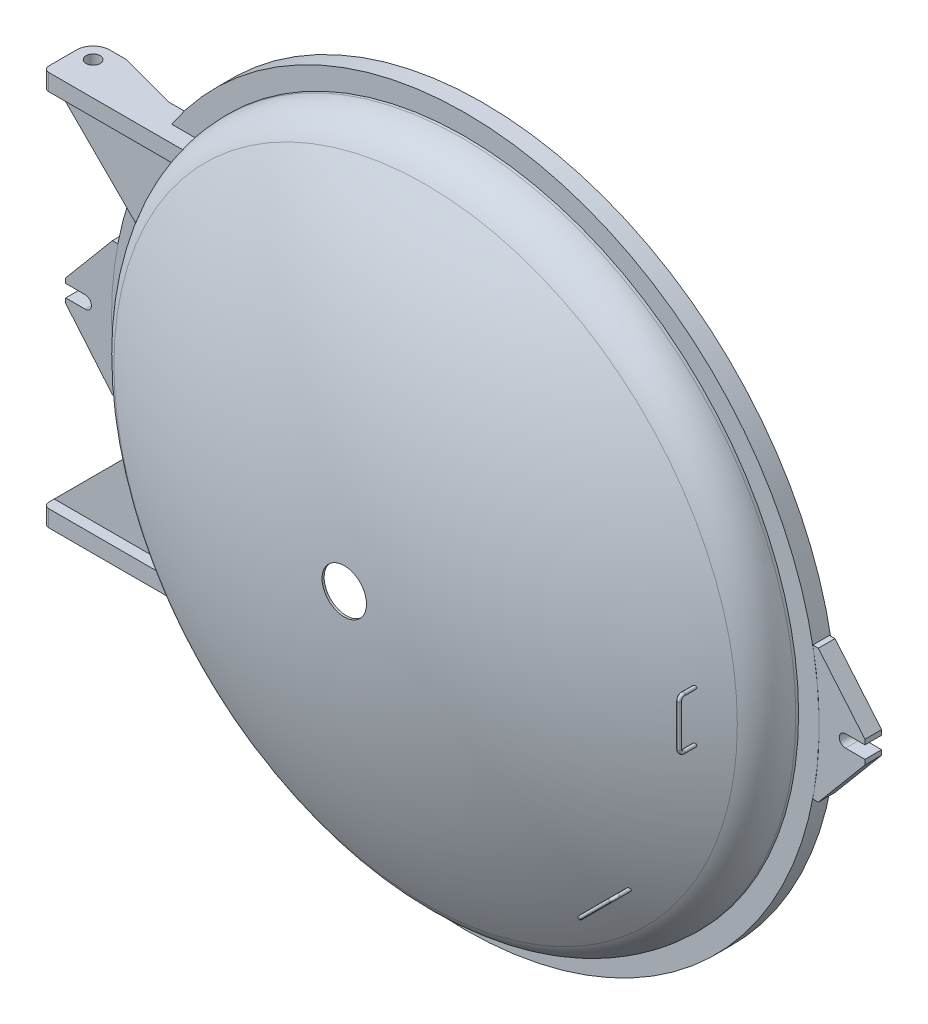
from build123d import *

# Parameters (mm, degrees)
BOSS_EXTRUDE1_START         = 76.2
BOSS_EXTRUDE1_DEPTH         = 76.2
BOSS_EXTRUDE2_REACH         = 4072.135
SKETCH4_R                   = 31.75
BOSS_EXTRUDE3_DEPTH         = 76.2
CUT_EXTRUDE1_DEPTH          = 25.4
FILLET1_R                   = 25.4
FILLET2_R                   = 76.2
FILLET1_OF_MIRROR2_R        = 25.4
FILLET2_OF_MIRROR2_R        = 76.2
CUT_EXTRUDE2_START          = -4.7625
SKETCH6_R                   = 1590.675
CUT_EXTRUDE2_DEPTH          = 4.7625
SKETCH8_R                   = 7.9375
CIRPATTERN1_COUNT           = 2
CIRPATTERN1_ANGLE           = 45
CIRPATTERN1_COPY_1_SKETCH_R = 7.9375


with BuildPart() as part:
    # Sketch1 → Revolve1 (revolve)
    with BuildSketch(Plane(origin=(0, 0, 0), x_dir=(1, 0, 0), z_dir=(0, 1, 0)), mode=Mode.PRIVATE) as revolve1_sk:
        with BuildLine():
            Line((1524, 0), (1524, -3.175))
            Line((1524, -3.175), (1514.475, -12.7))
            Line((1514.475, -12.7), (1514.475, -88.9))
            ThreePointArc((1514.475, -88.9), (1489.304816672, -181.833526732), (1420.674941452, -249.362178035))
            ThreePointArc((1420.674941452, -249.362178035), (783.378943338, -513.8512381), (101.6, -620.049752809))
            Line((101.6, -620.049752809), (101.6, -629.580602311))
            ThreePointArc((101.6, -629.580602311), (785.794874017, -523.066267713), (1425.348214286, -257.661945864))
            ThreePointArc((1425.348214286, -257.661945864), (1497.527910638, -186.640433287), (1524, -88.9))
            Line((1524, -88.9), (1524, -76.2))
            Line((1524, -76.2), (1617.6625, -76.2))
            Line((1617.6625, -76.2), (1617.6625, 4.7625))
            Line((1617.6625, 4.7625), (1590.675, 4.7625))
            Line((1590.675, 4.7625), (1590.675, 0))
            Line((1590.675, 0), (1524, 0))
        make_face()
    revolve(revolve1_sk.sketch.rotate(Axis((0, 0, -88.99), (0, 0, 1)), 180), axis=Axis((0, 0, -88.99), (0, 0, 1)))

    # Sketch2 → Boss-Extrude1 (add)
    with BuildSketch(Plane(origin=(0, 0, 76.073), x_dir=(-1, 0, 0), z_dir=(0, 0, -1)).offset(BOSS_EXTRUDE1_START)):
        with BuildLine():
            Line((-1588.687799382, 304.8), (-1614.087799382, 304.8))
            Line((-1614.087799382, 304.8), (-1827.2125, 50.8))
            Line((-1827.2125, 50.8), (-1827.2125, 28.575))
            Line((-1827.2125, 28.575), (-1738.3125, 28.575))
            ThreePointArc((-1738.3125, 28.575), (-1709.7375, 0), (-1738.3125, -28.575))
            Line((-1738.3125, -28.575), (-1827.2125, -28.575))
            Line((-1827.2125, -28.575), (-1827.2125, -50.8))
            Line((-1827.2125, -50.8), (-1614.087799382, -304.8))
            Line((-1614.087799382, -304.8), (-1588.687799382, -304.8))
            ThreePointArc((-1588.687799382, -304.8), (-1617.6625, 0), (-1588.687799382, 304.8))
        make_face()
    boss_extrude1 = extrude(amount=-BOSS_EXTRUDE1_DEPTH)

    # Mirror1: Boss-Extrude1 across plane
    add(boss_extrude1.mirror(Plane(origin=(0, 0, 0), x_dir=(0, 0, 1), z_dir=(1, 0, 0))))

    # Sketch3 → Boss-Extrude2 (add, up to next)
    with BuildSketch(Plane(origin=(-1854.2, 0, 0), x_dir=(0, 0, -1), z_dir=(1, 0, 0)), mode=Mode.PRIVATE) as boss_extrude2_sk1:
        Polygon((-76.2, 901.7), (-152.4, 901.7), (-152.4, 825.5), (-101.6, 825.5), (-101.6, 431.8), (-76.2, 431.8), align=None)
    boss_extrude2_tool1 = extrude(boss_extrude2_sk1.sketch, amount=BOSS_EXTRUDE2_REACH, mode=Mode.PRIVATE) - part.part
    boss_extrude2 = boss_extrude2_tool1.solids().sort_by_distance((-1854.2, 714.958163, 98.230612))[0]
    add(boss_extrude2)

    # Sketch4 → Boss-Extrude3 (add)
    with BuildSketch(Plane(origin=(0, 901.7, 0), x_dir=(1, 0, 0), z_dir=(0, 1, 0))):
        Polygon((-1854.2, -76.2), (-1343.04470287, -76.2), (-1343.04470287, 4.7625), (-1435.191620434, 4.7625), (-1701.8, 76.2), (-1854.2, 76.2), align=None)
        with Locations(Location((-1778, 0, 0), (0, 0, 270))):
            Circle(SKETCH4_R, mode=Mode.SUBTRACT)
    boss_extrude3 = extrude(amount=-BOSS_EXTRUDE3_DEPTH)

    # Sketch5 → Cut-Extrude1 (cut)
    with BuildSketch(Plane.XY.offset(101.6)):
        with BuildLine():
            Line((-1854.2, 825.5), (-1461.309385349, 432.609385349))
            ThreePointArc((-1461.309385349, 432.609385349), (-1461.429125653, 432.204709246), (-1461.548753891, 431.8))
            Line((-1461.548753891, 431.8), (-1854.2, 431.8))
            Line((-1854.2, 431.8), (-1854.2, 825.5))
        make_face()
    cut_extrude1 = extrude(amount=-CUT_EXTRUDE1_DEPTH, mode=Mode.SUBTRACT)

    # Fillet1
    fillet1_edges = [part.edges().sort_by_distance(p)[0] for p in [
        (-1435.191620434, 863.6, -4.7625),
        (-1701.8, 863.6, -76.2),
        (-1854.2, 863.6, 152.4),
    ]]
    fillet(fillet1_edges, radius=FILLET1_R)

    # Fillet2
    fillet2_edges = [part.edges().sort_by_distance(p)[0] for p in [
        (-1854.2, 863.6, -76.2),
    ]]
    fillet(fillet2_edges, radius=FILLET2_R)

    # Mirror2: Boss-Extrude2, Boss-Extrude3, Cut-Extrude1 across plane
    add(boss_extrude2.mirror(Plane.ZX))
    add(boss_extrude3.mirror(Plane.ZX))
    add(cut_extrude1.mirror(Plane.ZX), mode=Mode.SUBTRACT)

    # Fillet1 of Mirror2
    fillet1_of_mirror2_edges = [part.edges().sort_by_distance(p)[0] for p in [
        (-1435.191620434, -863.6, -4.7625),
        (-1701.8, -863.6, -76.2),
        (-1854.2, -863.6, 152.4),
    ]]
    fillet(fillet1_of_mirror2_edges, radius=FILLET1_OF_MIRROR2_R)

    # Fillet2 of Mirror2
    fillet2_of_mirror2_edges = [part.edges().sort_by_distance(p)[0] for p in [
        (-1854.2, -863.6, -76.2),
    ]]
    fillet(fillet2_of_mirror2_edges, radius=FILLET2_OF_MIRROR2_R)

    # Sketch6 → Cut-Extrude2 (cut)
    with BuildSketch(Plane(origin=(0, 0, -4.7625), x_dir=(-1, 0, 0), z_dir=(0, 0, -1)).offset(CUT_EXTRUDE2_START)):
        Circle(SKETCH6_R)
    extrude(amount=CUT_EXTRUDE2_DEPTH, mode=Mode.SUBTRACT)

    # Sweep1: sweep along a path in Sketch7
    with BuildLine(Plane(origin=(1295.4, 0, 0), x_dir=(0, 0, -1), z_dir=(1, 0, 0))) as sweep1_path:
        Line((-393.7, 0), (-393.7, 95.25))
        ThreePointArc((-393.7, 95.25), (-388.120384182, 108.720384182), (-374.65, 114.3))
        Line((-374.65, 114.3), (-317.5, 114.3))
    # Sketch8 → Sweep1 (sweep)
    with BuildSketch(Plane(origin=(0, 0, 0), x_dir=(1, 0, 0), z_dir=(0, 1, 0))):
        with Locations((1295.4, -393.7)):
            Circle(SKETCH8_R)
    sweep1 = sweep(path=sweep1_path.line)

    # Mirror3: Sweep1 across plane
    add(sweep1.mirror(Plane.ZX))

    # CirPattern1: Sweep1 ×2 about axis
    cirpattern1_axis = Axis((0, 0, 0), (0, 0, -1))
    for i in range(1, CIRPATTERN1_COUNT):
        add(sweep1.rotate(cirpattern1_axis, i * CIRPATTERN1_ANGLE / (CIRPATTERN1_COUNT - 1)))

    # CirPattern1 copy 1: sweep along a path in CirPattern1 copy 1 path
    with BuildLine(Plane(origin=(915.986124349, -915.986124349, 0), x_dir=(0, 0, -1), z_dir=(0.7071067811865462, -0.7071067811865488, 0))) as cirpattern1_copy_1_path:
        Line((-393.7, 0), (-393.7, -95.25))
        ThreePointArc((-393.7, -95.25), (-388.120384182, -108.720384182), (-374.65, -114.3))
        Line((-374.65, -114.3), (-317.5, -114.3))
    # CirPattern1 copy 1 sketch → CirPattern1 copy 1 (sweep)
    with BuildSketch(Plane(origin=(0, 0, 0), x_dir=(0.7071067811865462, -0.7071067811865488, 0), z_dir=(-0.7071067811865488, -0.7071067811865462, 0))):
        with Locations((1295.4, 393.7)):
            Circle(CIRPATTERN1_COPY_1_SKETCH_R)
    sweep(path=cirpattern1_copy_1_path.line)


solid = part.part
